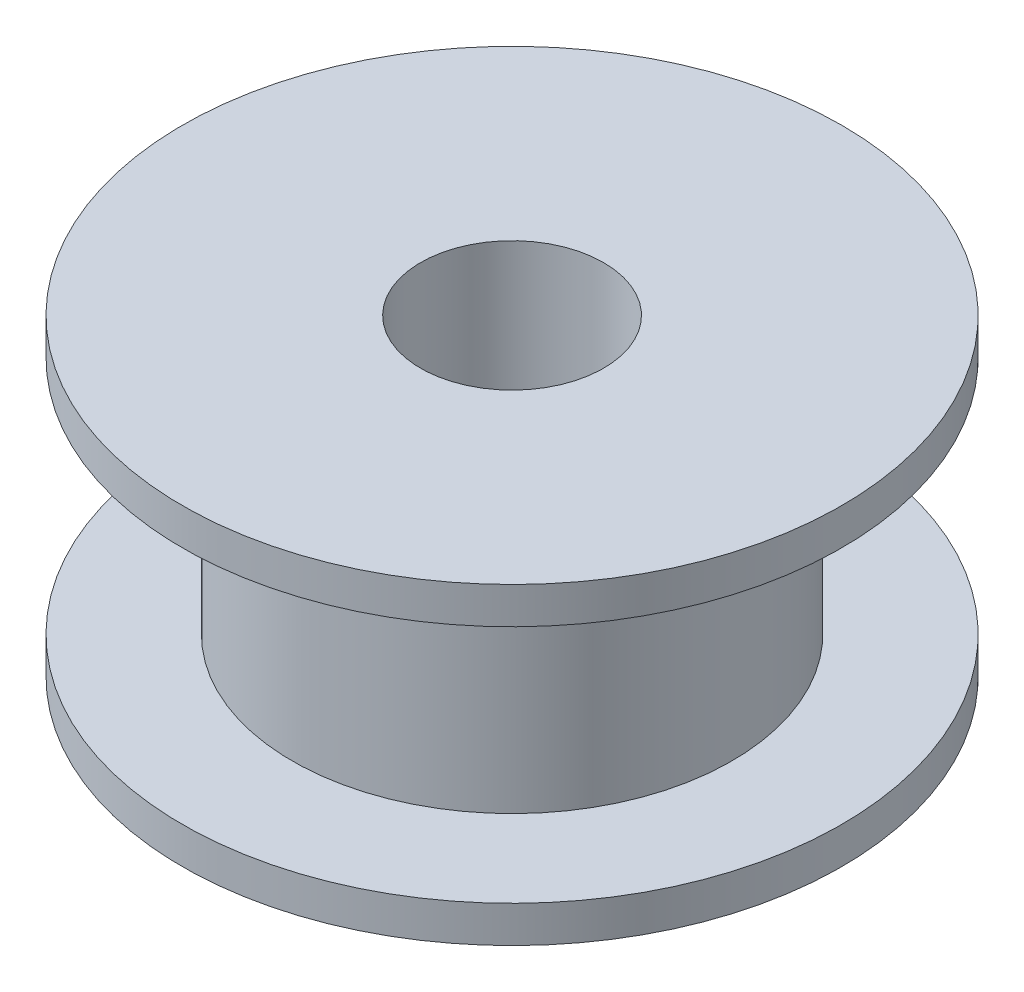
from build123d import *


with BuildPart() as part:
    # Sketch1 → Revolve1 (revolve)
    with BuildSketch(Plane.XY, mode=Mode.PRIVATE) as revolve1_sk:
        Polygon((2.5, 0), (2.5, 8.54), (9, 8.54), (9, 7.54), (6, 7.54), (6, 1), (9, 1), (9, 0), align=None)
    revolve(revolve1_sk.sketch.rotate(Axis((0, 0, 0), (0, 1, 0)), 90), axis=Axis((0, 0, 0), (0, 1, 0)))


solid = part.part
